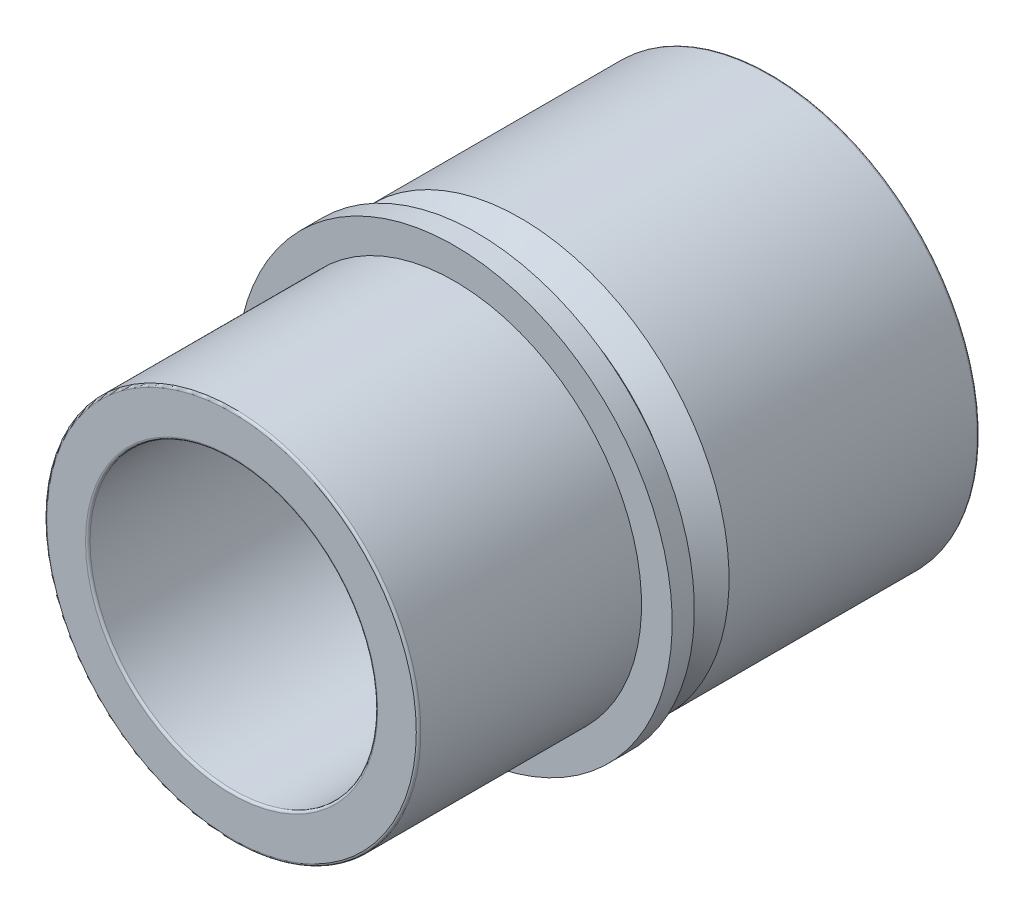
from build123d import *


with BuildPart() as part:
    # Logo3_bib1 → Revolve1 (revolve)
    with BuildSketch(Plane(origin=(0, 0, 0), x_dir=(-1, 0, 0), z_dir=(0, -1, 0))):
        with BuildLine():
            Line((31.75, 69.342), (31.75, -48.7045))
            ThreePointArc((31.75, -48.7045), (31.898789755, -49.063710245), (32.258, -49.2125))
            Line((32.258, -49.2125), (40.767, -49.2125))
            ThreePointArc((40.767, -49.2125), (41.126210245, -49.063710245), (41.275, -48.7045))
            Line((41.275, -48.7045), (41.275, 0))
            Line((41.275, 0), (48.0441, 0))
            Line((48.0441, 0), (48.0441, 4.9022))
            Line((48.0441, 4.9022), (41.275, 4.9022))
            Line((41.275, 4.9022), (41.275, 9.8044))
            Line((41.275, 9.8044), (46.0375, 14.5669))
            Line((46.0375, 14.5669), (46.0375, 69.342))
            ThreePointArc((46.0375, 69.342), (45.888710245, 69.701210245), (45.5295, 69.85))
            Line((45.5295, 69.85), (32.258, 69.85))
            ThreePointArc((32.258, 69.85), (31.898789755, 69.701210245), (31.75, 69.342))
        make_face()
    revolve(axis=Axis((0, 0, -41.537203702), (0, 0, 1)))


solid = part.part
